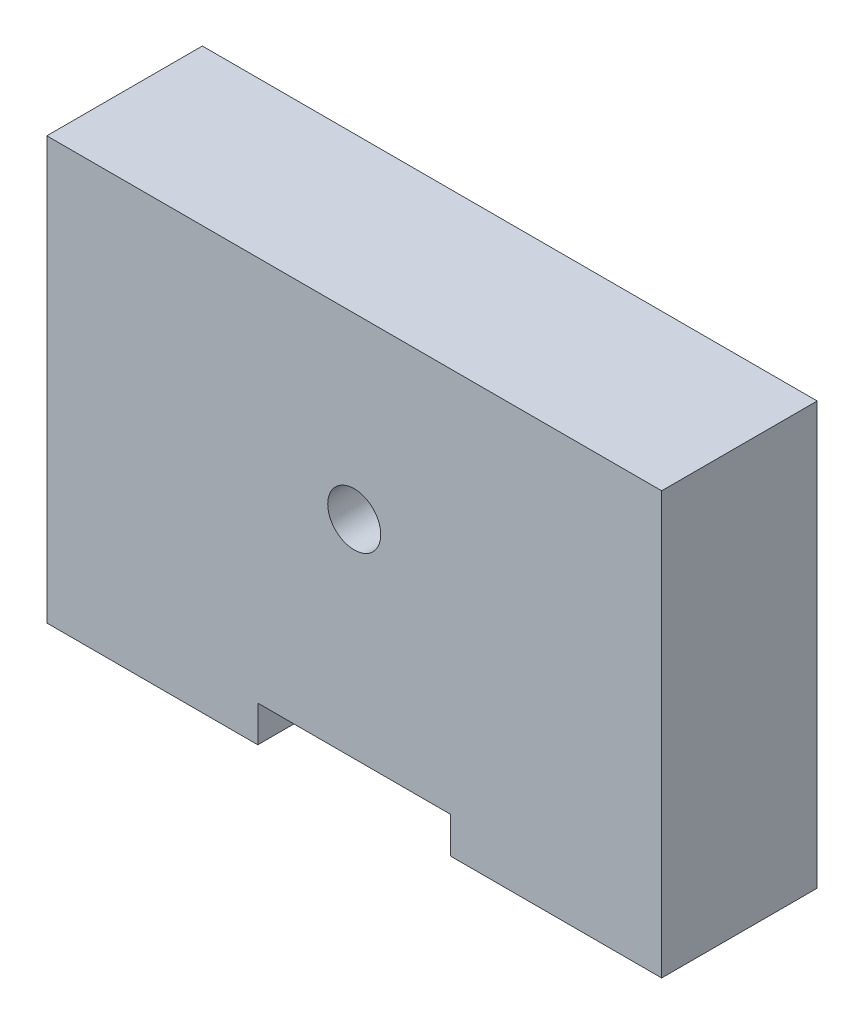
ISO-10303-21;
HEADER;
FILE_DESCRIPTION(('STEP AP214'),'2;1');
FILE_NAME('part.step','',(''),(''),'','','');
FILE_SCHEMA(('AUTOMOTIVE_DESIGN { 1 0 10303 214 1 1 1 1 }'));
ENDSEC;
DATA;
#1=APPLICATION_CONTEXT('core data for automotive mechanical design processes');
#2=APPLICATION_PROTOCOL_DEFINITION('international standard','automotive_design',2000,#1);
#3=PRODUCT_CONTEXT('',#1,'mechanical');
#4=PRODUCT('Part','Part','',(#3));
#5=PRODUCT_RELATED_PRODUCT_CATEGORY('part','',(#4));
#6=PRODUCT_DEFINITION_FORMATION('','',#4);
#7=PRODUCT_DEFINITION_CONTEXT('part definition',#1,'design');
#8=PRODUCT_DEFINITION('design','',#6,#7);
#9=PRODUCT_DEFINITION_SHAPE('','',#8);
#10=(LENGTH_UNIT() NAMED_UNIT(*) SI_UNIT(.MILLI.,.METRE.));
#11=(NAMED_UNIT(*) PLANE_ANGLE_UNIT() SI_UNIT($,.RADIAN.));
#12=(NAMED_UNIT(*) SI_UNIT($,.STERADIAN.) SOLID_ANGLE_UNIT());
#13=UNCERTAINTY_MEASURE_WITH_UNIT(LENGTH_MEASURE(1.E-05),#10,'distance_accuracy_value','');
#14=(GEOMETRIC_REPRESENTATION_CONTEXT(3) GLOBAL_UNCERTAINTY_ASSIGNED_CONTEXT((#13)) GLOBAL_UNIT_ASSIGNED_CONTEXT((#10,
#11,#12)) REPRESENTATION_CONTEXT('',''));
#15=CARTESIAN_POINT('',(0.,0.,0.));
#16=DIRECTION('',(0.,0.,1.));
#17=DIRECTION('',(1.,0.,0.));
#18=AXIS2_PLACEMENT_3D('',#15,#16,#17);
#19=CARTESIAN_POINT('',(0.,0.,0.));
#20=DIRECTION('',(0.,-1.,0.));
#21=DIRECTION('',(0.,0.,-1.));
#22=AXIS2_PLACEMENT_3D('',#19,#20,#21);
#23=PLANE('',#22);
#24=DIRECTION('',(0.,0.,-1.));
#25=VECTOR('',#24,1.);
#26=CARTESIAN_POINT('',(8.,0.,22.7288205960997));
#27=LINE('',#26,#25);
#28=CARTESIAN_POINT('',(8.,0.,6.45));
#29=VERTEX_POINT('',#28);
#30=CARTESIAN_POINT('',(8.,0.,-6.45));
#31=VERTEX_POINT('',#30);
#32=EDGE_CURVE('E127',#29,#31,#27,.T.);
#33=ORIENTED_EDGE('',*,*,#32,.T.);
#34=DIRECTION('',(-1.,0.,0.));
#35=VECTOR('',#34,1.);
#36=CARTESIAN_POINT('',(25.5,0.,-6.45000000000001));
#37=LINE('',#36,#35);
#38=CARTESIAN_POINT('',(25.5,0.,-6.45000000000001));
#39=VERTEX_POINT('',#38);
#40=EDGE_CURVE('E139',#39,#31,#37,.T.);
#41=ORIENTED_EDGE('',*,*,#40,.F.);
#42=DIRECTION('',(0.,0.,-1.));
#43=VECTOR('',#42,1.);
#44=CARTESIAN_POINT('',(25.5,0.,-6.45000000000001));
#45=LINE('',#44,#43);
#46=CARTESIAN_POINT('',(25.5,0.,6.45000000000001));
#47=VERTEX_POINT('',#46);
#48=EDGE_CURVE('E150',#47,#39,#45,.T.);
#49=ORIENTED_EDGE('',*,*,#48,.F.);
#50=DIRECTION('',(1.,0.,0.));
#51=VECTOR('',#50,1.);
#52=CARTESIAN_POINT('',(25.5,0.,6.45000000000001));
#53=LINE('',#52,#51);
#54=EDGE_CURVE('E89',#29,#47,#53,.T.);
#55=ORIENTED_EDGE('',*,*,#54,.F.);
#56=EDGE_LOOP('',(#33,#41,#49,#55));
#57=FACE_BOUND('',#56,.T.);
#58=CARTESIAN_POINT('',(18.75,0.,0.));
#59=DIRECTION('',(0.,-1.,0.));
#60=DIRECTION('',(0.,0.,-1.));
#61=AXIS2_PLACEMENT_3D('',#58,#59,#60);
#62=CIRCLE('',#61,2.1);
#63=CARTESIAN_POINT('',(18.75,0.,-2.1));
#64=VERTEX_POINT('',#63);
#65=EDGE_CURVE('E190',#64,#64,#62,.T.);
#66=ORIENTED_EDGE('',*,*,#65,.F.);
#67=EDGE_LOOP('',(#66));
#68=FACE_BOUND('',#67,.T.);
#69=ADVANCED_FACE('F44',(#57,#68),#23,.T.);
#70=CARTESIAN_POINT('',(25.5,35.,-6.45000000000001));
#71=DIRECTION('',(-1.,0.,0.));
#72=DIRECTION('',(0.,0.,1.));
#73=AXIS2_PLACEMENT_3D('',#70,#71,#72);
#74=PLANE('',#73);
#75=ORIENTED_EDGE('',*,*,#48,.T.);
#76=DIRECTION('',(0.,-1.,0.));
#77=VECTOR('',#76,1.);
#78=CARTESIAN_POINT('',(25.5,35.,-6.45000000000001));
#79=LINE('',#78,#77);
#80=CARTESIAN_POINT('',(25.5,35.,-6.45000000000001));
#81=VERTEX_POINT('',#80);
#82=EDGE_CURVE('E11',#81,#39,#79,.T.);
#83=ORIENTED_EDGE('',*,*,#82,.F.);
#84=DIRECTION('',(0.,0.,-1.));
#85=VECTOR('',#84,1.);
#86=CARTESIAN_POINT('',(25.5,35.,-6.45000000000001));
#87=LINE('',#86,#85);
#88=CARTESIAN_POINT('',(25.5,35.,6.45000000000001));
#89=VERTEX_POINT('',#88);
#90=EDGE_CURVE('E157',#89,#81,#87,.T.);
#91=ORIENTED_EDGE('',*,*,#90,.F.);
#92=DIRECTION('',(0.,-1.,0.));
#93=VECTOR('',#92,1.);
#94=CARTESIAN_POINT('',(25.5,35.,6.45000000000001));
#95=LINE('',#94,#93);
#96=EDGE_CURVE('E158',#89,#47,#95,.T.);
#97=ORIENTED_EDGE('',*,*,#96,.T.);
#98=EDGE_LOOP('',(#75,#83,#91,#97));
#99=FACE_BOUND('',#98,.T.);
#100=ADVANCED_FACE('F46',(#99),#74,.F.);
#101=CARTESIAN_POINT('',(25.5,35.,-6.45000000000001));
#102=DIRECTION('',(0.,0.,1.));
#103=DIRECTION('',(1.,0.,0.));
#104=AXIS2_PLACEMENT_3D('',#101,#102,#103);
#105=PLANE('',#104);
#106=CARTESIAN_POINT('',(0.,20.2,-6.45));
#107=DIRECTION('',(0.,0.,-1.));
#108=DIRECTION('',(-1.,0.,0.));
#109=AXIS2_PLACEMENT_3D('',#106,#107,#108);
#110=CIRCLE('',#109,2.2);
#111=CARTESIAN_POINT('',(-2.2,20.2,-6.45));
#112=VERTEX_POINT('',#111);
#113=EDGE_CURVE('E134',#112,#112,#110,.T.);
#114=ORIENTED_EDGE('',*,*,#113,.F.);
#115=EDGE_LOOP('',(#114));
#116=FACE_BOUND('',#115,.T.);
#117=ORIENTED_EDGE('',*,*,#40,.T.);
#118=DIRECTION('',(0.,-1.,0.));
#119=VECTOR('',#118,1.);
#120=CARTESIAN_POINT('',(8.,0.,-6.45));
#121=LINE('',#120,#119);
#122=CARTESIAN_POINT('',(8.,3.,-6.45));
#123=VERTEX_POINT('',#122);
#124=EDGE_CURVE('E124',#123,#31,#121,.T.);
#125=ORIENTED_EDGE('',*,*,#124,.F.);
#126=DIRECTION('',(1.,0.,0.));
#127=VECTOR('',#126,1.);
#128=CARTESIAN_POINT('',(8.,3.,-6.45));
#129=LINE('',#128,#127);
#130=CARTESIAN_POINT('',(-8.,3.,-6.45));
#131=VERTEX_POINT('',#130);
#132=EDGE_CURVE('E141',#131,#123,#129,.T.);
#133=ORIENTED_EDGE('',*,*,#132,.F.);
#134=DIRECTION('',(0.,1.,0.));
#135=VECTOR('',#134,1.);
#136=CARTESIAN_POINT('',(-8.,0.,-6.45));
#137=LINE('',#136,#135);
#138=CARTESIAN_POINT('',(-8.,0.,-6.45));
#139=VERTEX_POINT('',#138);
#140=EDGE_CURVE('E133',#139,#131,#137,.T.);
#141=ORIENTED_EDGE('',*,*,#140,.F.);
#142=CARTESIAN_POINT('',(-25.5,0.,-6.45));
#143=VERTEX_POINT('',#142);
#144=EDGE_CURVE('E147',#139,#143,#37,.T.);
#145=ORIENTED_EDGE('',*,*,#144,.T.);
#146=DIRECTION('',(0.,-1.,0.));
#147=VECTOR('',#146,1.);
#148=CARTESIAN_POINT('',(-25.5,35.,-6.45));
#149=LINE('',#148,#147);
#150=CARTESIAN_POINT('',(-25.5,35.,-6.45));
#151=VERTEX_POINT('',#150);
#152=EDGE_CURVE('E52',#151,#143,#149,.T.);
#153=ORIENTED_EDGE('',*,*,#152,.F.);
#154=DIRECTION('',(-1.,0.,0.));
#155=VECTOR('',#154,1.);
#156=CARTESIAN_POINT('',(25.5,35.,-6.45000000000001));
#157=LINE('',#156,#155);
#158=EDGE_CURVE('E96',#81,#151,#157,.T.);
#159=ORIENTED_EDGE('',*,*,#158,.F.);
#160=ORIENTED_EDGE('',*,*,#82,.T.);
#161=EDGE_LOOP('',(#117,#125,#133,#141,#145,#153,#159,#160));
#162=FACE_BOUND('',#161,.T.);
#163=ADVANCED_FACE('F143',(#116,#162),#105,.F.);
#164=CARTESIAN_POINT('',(-25.5,35.,-6.45));
#165=DIRECTION('',(1.,0.,0.));
#166=DIRECTION('',(0.,0.,-1.));
#167=AXIS2_PLACEMENT_3D('',#164,#165,#166);
#168=PLANE('',#167);
#169=DIRECTION('',(0.,0.,1.));
#170=VECTOR('',#169,1.);
#171=CARTESIAN_POINT('',(-25.5,0.,-6.45));
#172=LINE('',#171,#170);
#173=CARTESIAN_POINT('',(-25.5,0.,6.45));
#174=VERTEX_POINT('',#173);
#175=EDGE_CURVE('E146',#143,#174,#172,.T.);
#176=ORIENTED_EDGE('',*,*,#175,.T.);
#177=DIRECTION('',(0.,-1.,0.));
#178=VECTOR('',#177,1.);
#179=CARTESIAN_POINT('',(-25.5,35.,6.45));
#180=LINE('',#179,#178);
#181=CARTESIAN_POINT('',(-25.5,35.,6.45));
#182=VERTEX_POINT('',#181);
#183=EDGE_CURVE('E160',#182,#174,#180,.T.);
#184=ORIENTED_EDGE('',*,*,#183,.F.);
#185=DIRECTION('',(0.,0.,1.));
#186=VECTOR('',#185,1.);
#187=CARTESIAN_POINT('',(-25.5,35.,-6.45));
#188=LINE('',#187,#186);
#189=EDGE_CURVE('E168',#151,#182,#188,.T.);
#190=ORIENTED_EDGE('',*,*,#189,.F.);
#191=ORIENTED_EDGE('',*,*,#152,.T.);
#192=EDGE_LOOP('',(#176,#184,#190,#191));
#193=FACE_BOUND('',#192,.T.);
#194=ADVANCED_FACE('F166',(#193),#168,.F.);
#195=CARTESIAN_POINT('',(25.5,35.,6.45000000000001));
#196=DIRECTION('',(0.,0.,-1.));
#197=DIRECTION('',(-1.,0.,0.));
#198=AXIS2_PLACEMENT_3D('',#195,#196,#197);
#199=PLANE('',#198);
#200=CARTESIAN_POINT('',(0.,20.2,6.45));
#201=DIRECTION('',(0.,0.,-1.));
#202=DIRECTION('',(-1.,0.,0.));
#203=AXIS2_PLACEMENT_3D('',#200,#201,#202);
#204=CIRCLE('',#203,2.2);
#205=CARTESIAN_POINT('',(-2.2,20.2,6.45));
#206=VERTEX_POINT('',#205);
#207=EDGE_CURVE('E196',#206,#206,#204,.F.);
#208=ORIENTED_EDGE('',*,*,#207,.F.);
#209=EDGE_LOOP('',(#208));
#210=FACE_BOUND('',#209,.T.);
#211=DIRECTION('',(-1.,0.,0.));
#212=VECTOR('',#211,1.);
#213=CARTESIAN_POINT('',(8.00000000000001,3.,6.45));
#214=LINE('',#213,#212);
#215=CARTESIAN_POINT('',(8.,3.,6.45));
#216=VERTEX_POINT('',#215);
#217=CARTESIAN_POINT('',(-8.,3.,6.45));
#218=VERTEX_POINT('',#217);
#219=EDGE_CURVE('E207',#216,#218,#214,.T.);
#220=ORIENTED_EDGE('',*,*,#219,.F.);
#221=DIRECTION('',(0.,1.,0.));
#222=VECTOR('',#221,1.);
#223=CARTESIAN_POINT('',(8.,0.,6.45));
#224=LINE('',#223,#222);
#225=EDGE_CURVE('E193',#29,#216,#224,.T.);
#226=ORIENTED_EDGE('',*,*,#225,.F.);
#227=ORIENTED_EDGE('',*,*,#54,.T.);
#228=ORIENTED_EDGE('',*,*,#96,.F.);
#229=DIRECTION('',(1.,0.,0.));
#230=VECTOR('',#229,1.);
#231=CARTESIAN_POINT('',(25.5,35.,6.45000000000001));
#232=LINE('',#231,#230);
#233=EDGE_CURVE('E68',#182,#89,#232,.T.);
#234=ORIENTED_EDGE('',*,*,#233,.F.);
#235=ORIENTED_EDGE('',*,*,#183,.T.);
#236=CARTESIAN_POINT('',(-8.,0.,6.45));
#237=VERTEX_POINT('',#236);
#238=EDGE_CURVE('E154',#174,#237,#53,.T.);
#239=ORIENTED_EDGE('',*,*,#238,.T.);
#240=DIRECTION('',(0.,-1.,0.));
#241=VECTOR('',#240,1.);
#242=CARTESIAN_POINT('',(-8.,0.,6.45));
#243=LINE('',#242,#241);
#244=EDGE_CURVE('E59',#218,#237,#243,.T.);
#245=ORIENTED_EDGE('',*,*,#244,.F.);
#246=EDGE_LOOP('',(#220,#226,#227,#228,#234,#235,#239,#245));
#247=FACE_BOUND('',#246,.T.);
#248=ADVANCED_FACE('F175',(#210,#247),#199,.F.);
#249=CARTESIAN_POINT('',(0.,35.,0.));
#250=DIRECTION('',(0.,-1.,0.));
#251=DIRECTION('',(0.,0.,-1.));
#252=AXIS2_PLACEMENT_3D('',#249,#250,#251);
#253=PLANE('',#252);
#254=ORIENTED_EDGE('',*,*,#90,.T.);
#255=ORIENTED_EDGE('',*,*,#158,.T.);
#256=ORIENTED_EDGE('',*,*,#189,.T.);
#257=ORIENTED_EDGE('',*,*,#233,.T.);
#258=EDGE_LOOP('',(#254,#255,#256,#257));
#259=FACE_BOUND('',#258,.T.);
#260=ADVANCED_FACE('F234',(#259),#253,.F.);
#261=DIRECTION('',(0.,0.,-1.));
#262=VECTOR('',#261,1.);
#263=CARTESIAN_POINT('',(-8.,0.,22.7288205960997));
#264=LINE('',#263,#262);
#265=EDGE_CURVE('E140',#237,#139,#264,.T.);
#266=ORIENTED_EDGE('',*,*,#265,.F.);
#267=ORIENTED_EDGE('',*,*,#238,.F.);
#268=ORIENTED_EDGE('',*,*,#175,.F.);
#269=ORIENTED_EDGE('',*,*,#144,.F.);
#270=EDGE_LOOP('',(#266,#267,#268,#269));
#271=FACE_BOUND('',#270,.T.);
#272=CARTESIAN_POINT('',(-18.75,0.,0.));
#273=DIRECTION('',(0.,-1.,0.));
#274=DIRECTION('',(0.,0.,-1.));
#275=AXIS2_PLACEMENT_3D('',#272,#273,#274);
#276=CIRCLE('',#275,2.1);
#277=CARTESIAN_POINT('',(-18.75,0.,-2.1));
#278=VERTEX_POINT('',#277);
#279=EDGE_CURVE('E184',#278,#278,#276,.T.);
#280=ORIENTED_EDGE('',*,*,#279,.F.);
#281=EDGE_LOOP('',(#280));
#282=FACE_BOUND('',#281,.T.);
#283=ADVANCED_FACE('F172',(#271,#282),#23,.T.);
#284=CARTESIAN_POINT('',(-18.75,12.4,0.));
#285=DIRECTION('',(0.,-1.,0.));
#286=DIRECTION('',(0.,0.,-1.));
#287=AXIS2_PLACEMENT_3D('',#284,#285,#286);
#288=CONICAL_SURFACE('',#287,2.1,1.02974425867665);
#289=CARTESIAN_POINT('',(-18.75,13.6618072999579,0.));
#290=VERTEX_POINT('',#289);
#291=VERTEX_LOOP('',#290);
#292=FACE_BOUND('',#291,.T.);
#293=CARTESIAN_POINT('',(-18.75,12.4,0.));
#294=DIRECTION('',(0.,-1.,0.));
#295=DIRECTION('',(0.,0.,-1.));
#296=AXIS2_PLACEMENT_3D('',#293,#294,#295);
#297=CIRCLE('',#296,2.1);
#298=CARTESIAN_POINT('',(-18.75,12.4,-2.1));
#299=VERTEX_POINT('',#298);
#300=EDGE_CURVE('E181',#299,#299,#297,.T.);
#301=ORIENTED_EDGE('',*,*,#300,.T.);
#302=EDGE_LOOP('',(#301));
#303=FACE_BOUND('',#302,.T.);
#304=ADVANCED_FACE('F233',(#292,#303),#288,.F.);
#305=CARTESIAN_POINT('',(-18.75,0.,0.));
#306=DIRECTION('',(0.,-1.,0.));
#307=DIRECTION('',(0.,0.,-1.));
#308=AXIS2_PLACEMENT_3D('',#305,#306,#307);
#309=CYLINDRICAL_SURFACE('',#308,2.1);
#310=ORIENTED_EDGE('',*,*,#300,.F.);
#311=EDGE_LOOP('',(#310));
#312=FACE_BOUND('',#311,.T.);
#313=ORIENTED_EDGE('',*,*,#279,.T.);
#314=EDGE_LOOP('',(#313));
#315=FACE_BOUND('',#314,.T.);
#316=ADVANCED_FACE('F239',(#312,#315),#309,.F.);
#317=CARTESIAN_POINT('',(18.75,12.4,0.));
#318=DIRECTION('',(0.,-1.,0.));
#319=DIRECTION('',(0.,0.,-1.));
#320=AXIS2_PLACEMENT_3D('',#317,#318,#319);
#321=CONICAL_SURFACE('',#320,2.1,1.02974425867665);
#322=CARTESIAN_POINT('',(18.75,13.6618072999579,0.));
#323=VERTEX_POINT('',#322);
#324=VERTEX_LOOP('',#323);
#325=FACE_BOUND('',#324,.T.);
#326=CARTESIAN_POINT('',(18.75,12.4,0.));
#327=DIRECTION('',(0.,-1.,0.));
#328=DIRECTION('',(0.,0.,-1.));
#329=AXIS2_PLACEMENT_3D('',#326,#327,#328);
#330=CIRCLE('',#329,2.1);
#331=CARTESIAN_POINT('',(18.75,12.4,-2.1));
#332=VERTEX_POINT('',#331);
#333=EDGE_CURVE('E187',#332,#332,#330,.T.);
#334=ORIENTED_EDGE('',*,*,#333,.T.);
#335=EDGE_LOOP('',(#334));
#336=FACE_BOUND('',#335,.T.);
#337=ADVANCED_FACE('F249',(#325,#336),#321,.F.);
#338=CARTESIAN_POINT('',(18.75,0.,0.));
#339=DIRECTION('',(0.,-1.,0.));
#340=DIRECTION('',(0.,0.,-1.));
#341=AXIS2_PLACEMENT_3D('',#338,#339,#340);
#342=CYLINDRICAL_SURFACE('',#341,2.1);
#343=ORIENTED_EDGE('',*,*,#333,.F.);
#344=EDGE_LOOP('',(#343));
#345=FACE_BOUND('',#344,.T.);
#346=ORIENTED_EDGE('',*,*,#65,.T.);
#347=EDGE_LOOP('',(#346));
#348=FACE_BOUND('',#347,.T.);
#349=ADVANCED_FACE('F253',(#345,#348),#342,.F.);
#350=CARTESIAN_POINT('',(8.,0.,22.7288205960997));
#351=DIRECTION('',(1.,0.,0.));
#352=DIRECTION('',(0.,0.,-1.));
#353=AXIS2_PLACEMENT_3D('',#350,#351,#352);
#354=PLANE('',#353);
#355=ORIENTED_EDGE('',*,*,#225,.T.);
#356=DIRECTION('',(0.,0.,-1.));
#357=VECTOR('',#356,1.);
#358=CARTESIAN_POINT('',(8.,3.,22.7288205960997));
#359=LINE('',#358,#357);
#360=EDGE_CURVE('E129',#216,#123,#359,.T.);
#361=ORIENTED_EDGE('',*,*,#360,.T.);
#362=ORIENTED_EDGE('',*,*,#124,.T.);
#363=ORIENTED_EDGE('',*,*,#32,.F.);
#364=EDGE_LOOP('',(#355,#361,#362,#363));
#365=FACE_BOUND('',#364,.T.);
#366=ADVANCED_FACE('F126',(#365),#354,.F.);
#367=CARTESIAN_POINT('',(8.,3.,22.7288205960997));
#368=DIRECTION('',(0.,1.,0.));
#369=DIRECTION('',(0.,0.,1.));
#370=AXIS2_PLACEMENT_3D('',#367,#368,#369);
#371=PLANE('',#370);
#372=ORIENTED_EDGE('',*,*,#219,.T.);
#373=DIRECTION('',(0.,0.,-1.));
#374=VECTOR('',#373,1.);
#375=CARTESIAN_POINT('',(-8.,3.,22.7288205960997));
#376=LINE('',#375,#374);
#377=EDGE_CURVE('E200',#218,#131,#376,.T.);
#378=ORIENTED_EDGE('',*,*,#377,.T.);
#379=ORIENTED_EDGE('',*,*,#132,.T.);
#380=ORIENTED_EDGE('',*,*,#360,.F.);
#381=EDGE_LOOP('',(#372,#378,#379,#380));
#382=FACE_BOUND('',#381,.T.);
#383=ADVANCED_FACE('F210',(#382),#371,.F.);
#384=CARTESIAN_POINT('',(-8.,0.,22.7288205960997));
#385=DIRECTION('',(-1.,0.,0.));
#386=DIRECTION('',(0.,0.,1.));
#387=AXIS2_PLACEMENT_3D('',#384,#385,#386);
#388=PLANE('',#387);
#389=ORIENTED_EDGE('',*,*,#244,.T.);
#390=ORIENTED_EDGE('',*,*,#265,.T.);
#391=ORIENTED_EDGE('',*,*,#140,.T.);
#392=ORIENTED_EDGE('',*,*,#377,.F.);
#393=EDGE_LOOP('',(#389,#390,#391,#392));
#394=FACE_BOUND('',#393,.T.);
#395=ADVANCED_FACE('F211',(#394),#388,.F.);
#396=CARTESIAN_POINT('',(0.,20.2,22.7288205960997));
#397=DIRECTION('',(0.,0.,-1.));
#398=DIRECTION('',(-1.,0.,0.));
#399=AXIS2_PLACEMENT_3D('',#396,#397,#398);
#400=CYLINDRICAL_SURFACE('',#399,2.2);
#401=ORIENTED_EDGE('',*,*,#207,.T.);
#402=EDGE_LOOP('',(#401));
#403=FACE_BOUND('',#402,.T.);
#404=ORIENTED_EDGE('',*,*,#113,.T.);
#405=EDGE_LOOP('',(#404));
#406=FACE_BOUND('',#405,.T.);
#407=ADVANCED_FACE('F214',(#403,#406),#400,.F.);
#408=CLOSED_SHELL('',(#69,#100,#163,#194,#248,#260,#283,#304,#316,#337,#349,#366,#383,#395,#407));
#409=MANIFOLD_SOLID_BREP('B2',#408);
#410=ADVANCED_BREP_SHAPE_REPRESENTATION('',(#18,#409),#14);
#411=SHAPE_DEFINITION_REPRESENTATION(#9,#410);
ENDSEC;
END-ISO-10303-21;
